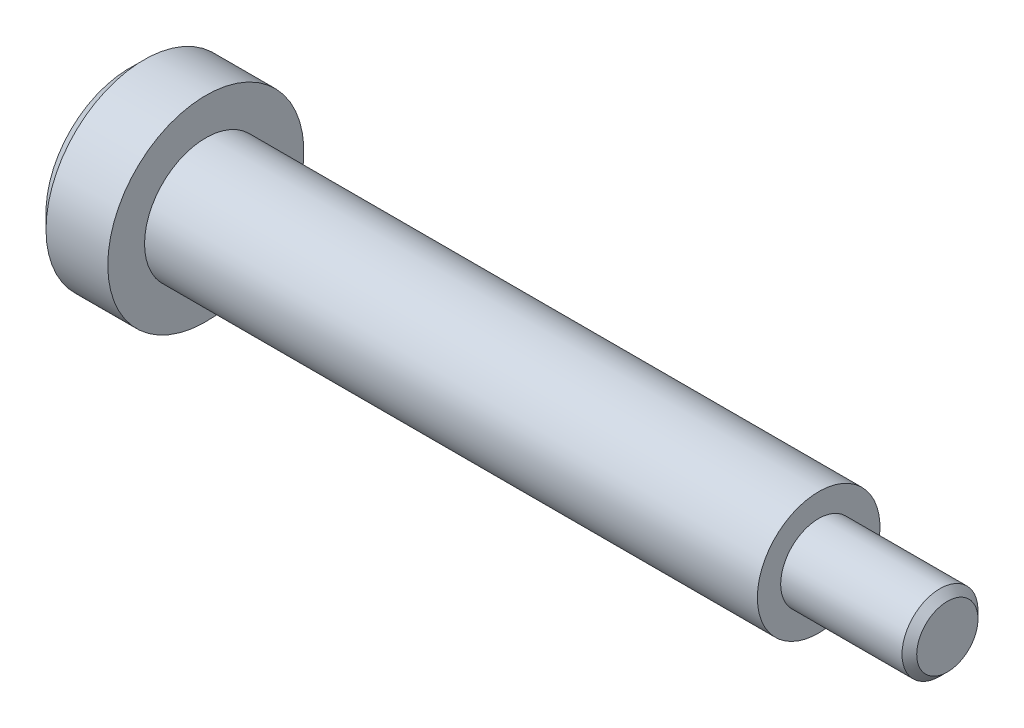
ISO-10303-21;
HEADER;
FILE_DESCRIPTION(('STEP AP214'),'2;1');
FILE_NAME('part.step','',(''),(''),'','','');
FILE_SCHEMA(('AUTOMOTIVE_DESIGN { 1 0 10303 214 1 1 1 1 }'));
ENDSEC;
DATA;
#1=APPLICATION_CONTEXT('core data for automotive mechanical design processes');
#2=APPLICATION_PROTOCOL_DEFINITION('international standard','automotive_design',2000,#1);
#3=PRODUCT_CONTEXT('',#1,'mechanical');
#4=PRODUCT('Part','Part','',(#3));
#5=PRODUCT_RELATED_PRODUCT_CATEGORY('part','',(#4));
#6=PRODUCT_DEFINITION_FORMATION('','',#4);
#7=PRODUCT_DEFINITION_CONTEXT('part definition',#1,'design');
#8=PRODUCT_DEFINITION('design','',#6,#7);
#9=PRODUCT_DEFINITION_SHAPE('','',#8);
#10=(LENGTH_UNIT() NAMED_UNIT(*) SI_UNIT(.MILLI.,.METRE.));
#11=(NAMED_UNIT(*) PLANE_ANGLE_UNIT() SI_UNIT($,.RADIAN.));
#12=(NAMED_UNIT(*) SI_UNIT($,.STERADIAN.) SOLID_ANGLE_UNIT());
#13=UNCERTAINTY_MEASURE_WITH_UNIT(LENGTH_MEASURE(1.E-05),#10,'distance_accuracy_value','');
#14=(GEOMETRIC_REPRESENTATION_CONTEXT(3) GLOBAL_UNCERTAINTY_ASSIGNED_CONTEXT((#13)) GLOBAL_UNIT_ASSIGNED_CONTEXT((#10,
#11,#12)) REPRESENTATION_CONTEXT('',''));
#15=CARTESIAN_POINT('',(0.,0.,0.));
#16=DIRECTION('',(0.,0.,1.));
#17=DIRECTION('',(1.,0.,0.));
#18=AXIS2_PLACEMENT_3D('',#15,#16,#17);
#19=CARTESIAN_POINT('',(-43.6499,0.,0.));
#20=DIRECTION('',(1.,0.,0.));
#21=DIRECTION('',(0.,0.,-1.));
#22=AXIS2_PLACEMENT_3D('',#19,#20,#21);
#23=PLANE('',#22);
#24=CARTESIAN_POINT('',(-43.6499,0.,0.));
#25=DIRECTION('',(1.,0.,0.));
#26=DIRECTION('',(0.,0.,-1.));
#27=AXIS2_PLACEMENT_3D('',#24,#25,#26);
#28=CIRCLE('',#27,8.63599999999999);
#29=CARTESIAN_POINT('',(-43.6499,0.,-8.63599999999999));
#30=VERTEX_POINT('',#29);
#31=EDGE_CURVE('E47',#30,#30,#28,.F.);
#32=ORIENTED_EDGE('',*,*,#31,.T.);
#33=EDGE_LOOP('',(#32));
#34=FACE_BOUND('',#33,.T.);
#35=ADVANCED_FACE('F32',(#34),#23,.F.);
#36=CARTESIAN_POINT('',(-46.865759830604,0.,0.));
#37=DIRECTION('',(-1.,0.,0.));
#38=DIRECTION('',(0.,0.,1.));
#39=AXIS2_PLACEMENT_3D('',#36,#37,#38);
#40=CYLINDRICAL_SURFACE('',#39,10.16);
#41=CARTESIAN_POINT('',(-42.1259,0.,0.));
#42=DIRECTION('',(1.,0.,0.));
#43=DIRECTION('',(0.,0.,-1.));
#44=AXIS2_PLACEMENT_3D('',#41,#42,#43);
#45=CIRCLE('',#44,10.16);
#46=CARTESIAN_POINT('',(-42.1259,0.,-10.16));
#47=VERTEX_POINT('',#46);
#48=EDGE_CURVE('E43',#47,#47,#45,.T.);
#49=ORIENTED_EDGE('',*,*,#48,.T.);
#50=EDGE_LOOP('',(#49));
#51=FACE_BOUND('',#50,.T.);
#52=CARTESIAN_POINT('',(-35.7251,0.,0.));
#53=DIRECTION('',(-1.,0.,0.));
#54=DIRECTION('',(0.,0.,1.));
#55=AXIS2_PLACEMENT_3D('',#52,#53,#54);
#56=CIRCLE('',#55,10.16);
#57=CARTESIAN_POINT('',(-35.7251,0.,10.16));
#58=VERTEX_POINT('',#57);
#59=EDGE_CURVE('E52',#58,#58,#56,.T.);
#60=ORIENTED_EDGE('',*,*,#59,.T.);
#61=EDGE_LOOP('',(#60));
#62=FACE_BOUND('',#61,.T.);
#63=ADVANCED_FACE('F81',(#51,#62),#40,.T.);
#64=CARTESIAN_POINT('',(-35.7251,10.16,0.));
#65=DIRECTION('',(-1.,0.,0.));
#66=DIRECTION('',(0.,0.,1.));
#67=AXIS2_PLACEMENT_3D('',#64,#65,#66);
#68=PLANE('',#67);
#69=ORIENTED_EDGE('',*,*,#59,.F.);
#70=EDGE_LOOP('',(#69));
#71=FACE_BOUND('',#70,.T.);
#72=CARTESIAN_POINT('',(-35.7251,0.,0.));
#73=DIRECTION('',(-1.,0.,0.));
#74=DIRECTION('',(0.,0.,1.));
#75=AXIS2_PLACEMENT_3D('',#72,#73,#74);
#76=CIRCLE('',#75,6.35);
#77=CARTESIAN_POINT('',(-35.7251,0.,6.35));
#78=VERTEX_POINT('',#77);
#79=EDGE_CURVE('E55',#78,#78,#76,.T.);
#80=ORIENTED_EDGE('',*,*,#79,.T.);
#81=EDGE_LOOP('',(#80));
#82=FACE_BOUND('',#81,.T.);
#83=ADVANCED_FACE('F87',(#71,#82),#68,.F.);
#84=CARTESIAN_POINT('',(-46.865759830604,0.,0.));
#85=DIRECTION('',(-1.,0.,0.));
#86=DIRECTION('',(0.,0.,1.));
#87=AXIS2_PLACEMENT_3D('',#84,#85,#86);
#88=CYLINDRICAL_SURFACE('',#87,6.35);
#89=ORIENTED_EDGE('',*,*,#79,.F.);
#90=EDGE_LOOP('',(#89));
#91=FACE_BOUND('',#90,.T.);
#92=CARTESIAN_POINT('',(27.7749,0.,0.));
#93=DIRECTION('',(-1.,0.,0.));
#94=DIRECTION('',(0.,0.,1.));
#95=AXIS2_PLACEMENT_3D('',#92,#93,#94);
#96=CIRCLE('',#95,6.35);
#97=CARTESIAN_POINT('',(27.7749,0.,6.35));
#98=VERTEX_POINT('',#97);
#99=EDGE_CURVE('E58',#98,#98,#96,.T.);
#100=ORIENTED_EDGE('',*,*,#99,.T.);
#101=EDGE_LOOP('',(#100));
#102=FACE_BOUND('',#101,.T.);
#103=ADVANCED_FACE('F77',(#91,#102),#88,.T.);
#104=CARTESIAN_POINT('',(27.7749,6.35,0.));
#105=DIRECTION('',(-1.,0.,0.));
#106=DIRECTION('',(0.,0.,1.));
#107=AXIS2_PLACEMENT_3D('',#104,#105,#106);
#108=PLANE('',#107);
#109=ORIENTED_EDGE('',*,*,#99,.F.);
#110=EDGE_LOOP('',(#109));
#111=FACE_BOUND('',#110,.T.);
#112=CARTESIAN_POINT('',(27.7749,0.,0.));
#113=DIRECTION('',(-1.,0.,0.));
#114=DIRECTION('',(0.,0.,1.));
#115=AXIS2_PLACEMENT_3D('',#112,#113,#114);
#116=CIRCLE('',#115,3.937);
#117=CARTESIAN_POINT('',(27.7749,0.,3.937));
#118=VERTEX_POINT('',#117);
#119=EDGE_CURVE('E61',#118,#118,#116,.T.);
#120=ORIENTED_EDGE('',*,*,#119,.T.);
#121=EDGE_LOOP('',(#120));
#122=FACE_BOUND('',#121,.T.);
#123=ADVANCED_FACE('F65',(#111,#122),#108,.F.);
#124=CARTESIAN_POINT('',(-46.865759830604,0.,0.));
#125=DIRECTION('',(-1.,0.,0.));
#126=DIRECTION('',(0.,0.,1.));
#127=AXIS2_PLACEMENT_3D('',#124,#125,#126);
#128=CYLINDRICAL_SURFACE('',#127,3.937);
#129=CARTESIAN_POINT('',(40.3479,0.,0.));
#130=DIRECTION('',(-1.,0.,0.));
#131=DIRECTION('',(0.,0.,1.));
#132=AXIS2_PLACEMENT_3D('',#129,#130,#131);
#133=CIRCLE('',#132,3.937);
#134=CARTESIAN_POINT('',(40.3479,0.,3.937));
#135=VERTEX_POINT('',#134);
#136=EDGE_CURVE('E39',#135,#135,#133,.T.);
#137=ORIENTED_EDGE('',*,*,#136,.T.);
#138=EDGE_LOOP('',(#137));
#139=FACE_BOUND('',#138,.T.);
#140=ORIENTED_EDGE('',*,*,#119,.F.);
#141=EDGE_LOOP('',(#140));
#142=FACE_BOUND('',#141,.T.);
#143=ADVANCED_FACE('F67',(#139,#142),#128,.T.);
#144=CARTESIAN_POINT('',(41.1099,3.937,0.));
#145=DIRECTION('',(-1.,0.,0.));
#146=DIRECTION('',(0.,0.,1.));
#147=AXIS2_PLACEMENT_3D('',#144,#145,#146);
#148=PLANE('',#147);
#149=CARTESIAN_POINT('',(41.1099,0.,0.));
#150=DIRECTION('',(-1.,0.,0.));
#151=DIRECTION('',(0.,0.,1.));
#152=AXIS2_PLACEMENT_3D('',#149,#150,#151);
#153=CIRCLE('',#152,3.17500000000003);
#154=CARTESIAN_POINT('',(41.1099,0.,3.17500000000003));
#155=VERTEX_POINT('',#154);
#156=EDGE_CURVE('E10',#155,#155,#153,.F.);
#157=ORIENTED_EDGE('',*,*,#156,.T.);
#158=EDGE_LOOP('',(#157));
#159=FACE_BOUND('',#158,.T.);
#160=ADVANCED_FACE('F69',(#159),#148,.F.);
#161=CARTESIAN_POINT('',(-43.6499,0.,0.));
#162=DIRECTION('',(1.,0.,0.));
#163=DIRECTION('',(0.,0.,-1.));
#164=AXIS2_PLACEMENT_3D('',#161,#162,#163);
#165=CONICAL_SURFACE('',#164,8.63599999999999,0.78539816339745);
#166=ORIENTED_EDGE('',*,*,#48,.F.);
#167=EDGE_LOOP('',(#166));
#168=FACE_BOUND('',#167,.T.);
#169=ORIENTED_EDGE('',*,*,#31,.F.);
#170=EDGE_LOOP('',(#169));
#171=FACE_BOUND('',#170,.T.);
#172=ADVANCED_FACE('F75',(#168,#171),#165,.T.);
#173=CARTESIAN_POINT('',(40.3479,0.,0.));
#174=DIRECTION('',(-1.,0.,0.));
#175=DIRECTION('',(0.,0.,1.));
#176=AXIS2_PLACEMENT_3D('',#173,#174,#175);
#177=CONICAL_SURFACE('',#176,3.937,0.785398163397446);
#178=ORIENTED_EDGE('',*,*,#156,.F.);
#179=EDGE_LOOP('',(#178));
#180=FACE_BOUND('',#179,.T.);
#181=ORIENTED_EDGE('',*,*,#136,.F.);
#182=EDGE_LOOP('',(#181));
#183=FACE_BOUND('',#182,.T.);
#184=ADVANCED_FACE('F34',(#180,#183),#177,.T.);
#185=CLOSED_SHELL('',(#35,#63,#83,#103,#123,#143,#160,#172,#184));
#186=MANIFOLD_SOLID_BREP('B2',#185);
#187=ADVANCED_BREP_SHAPE_REPRESENTATION('',(#18,#186),#14);
#188=SHAPE_DEFINITION_REPRESENTATION(#9,#187);
ENDSEC;
END-ISO-10303-21;
